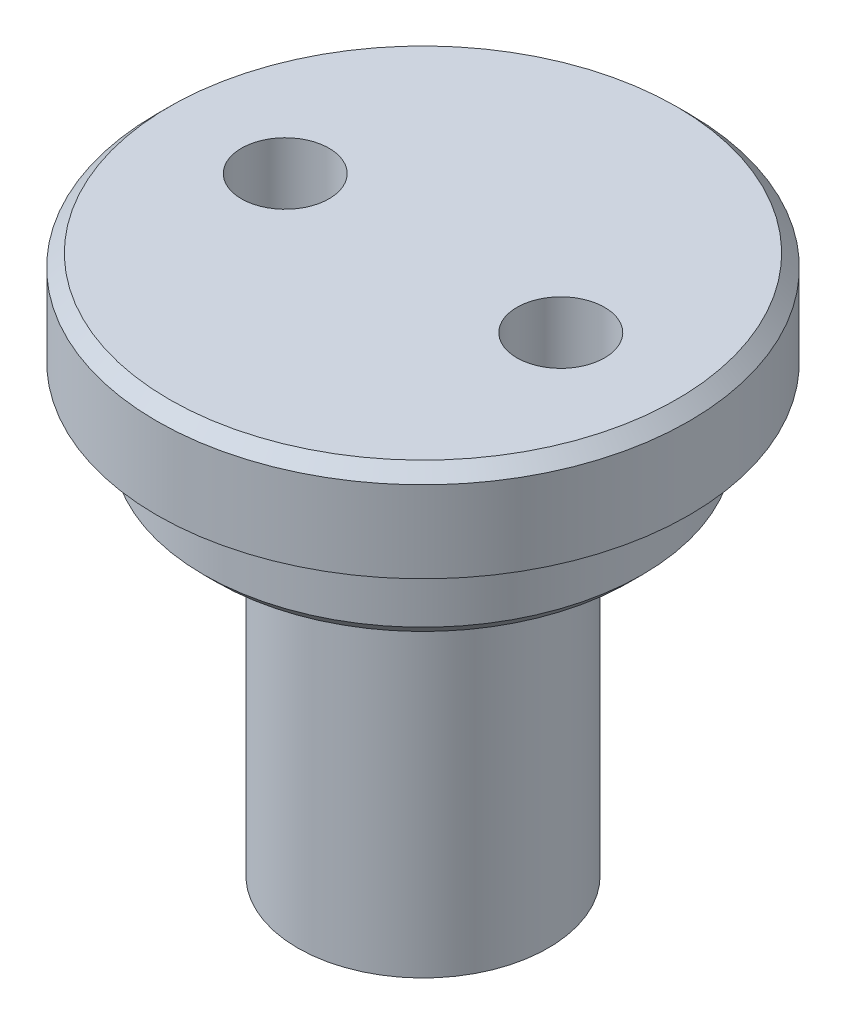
ISO-10303-21;
HEADER;
FILE_DESCRIPTION(('STEP AP214'),'2;1');
FILE_NAME('part.step','',(''),(''),'','','');
FILE_SCHEMA(('AUTOMOTIVE_DESIGN { 1 0 10303 214 1 1 1 1 }'));
ENDSEC;
DATA;
#1=APPLICATION_CONTEXT('core data for automotive mechanical design processes');
#2=APPLICATION_PROTOCOL_DEFINITION('international standard','automotive_design',2000,#1);
#3=PRODUCT_CONTEXT('',#1,'mechanical');
#4=PRODUCT('Part','Part','',(#3));
#5=PRODUCT_RELATED_PRODUCT_CATEGORY('part','',(#4));
#6=PRODUCT_DEFINITION_FORMATION('','',#4);
#7=PRODUCT_DEFINITION_CONTEXT('part definition',#1,'design');
#8=PRODUCT_DEFINITION('design','',#6,#7);
#9=PRODUCT_DEFINITION_SHAPE('','',#8);
#10=(LENGTH_UNIT() NAMED_UNIT(*) SI_UNIT(.MILLI.,.METRE.));
#11=(NAMED_UNIT(*) PLANE_ANGLE_UNIT() SI_UNIT($,.RADIAN.));
#12=(NAMED_UNIT(*) SI_UNIT($,.STERADIAN.) SOLID_ANGLE_UNIT());
#13=UNCERTAINTY_MEASURE_WITH_UNIT(LENGTH_MEASURE(1.E-05),#10,'distance_accuracy_value','');
#14=(GEOMETRIC_REPRESENTATION_CONTEXT(3) GLOBAL_UNCERTAINTY_ASSIGNED_CONTEXT((#13)) GLOBAL_UNIT_ASSIGNED_CONTEXT((#10,
#11,#12)) REPRESENTATION_CONTEXT('',''));
#15=CARTESIAN_POINT('',(0.,0.,0.));
#16=DIRECTION('',(0.,0.,1.));
#17=DIRECTION('',(1.,0.,0.));
#18=AXIS2_PLACEMENT_3D('',#15,#16,#17);
#19=CARTESIAN_POINT('',(0.,-8.9,0.));
#20=DIRECTION('',(0.,-1.,0.));
#21=DIRECTION('',(0.,0.,-1.));
#22=AXIS2_PLACEMENT_3D('',#19,#20,#21);
#23=PLANE('',#22);
#24=CARTESIAN_POINT('',(0.,-8.89999999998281,0.));
#25=DIRECTION('',(0.,1.,0.));
#26=DIRECTION('',(0.,0.,1.));
#27=AXIS2_PLACEMENT_3D('',#24,#25,#26);
#28=CIRCLE('',#27,1.50000000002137);
#29=CARTESIAN_POINT('',(0.,-8.89999999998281,1.50000000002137));
#30=VERTEX_POINT('',#29);
#31=EDGE_CURVE('P0_E17',#30,#30,#28,.T.);
#32=ORIENTED_EDGE('',*,*,#31,.F.);
#33=EDGE_LOOP('',(#32));
#34=FACE_BOUND('',#33,.T.);
#35=ADVANCED_FACE('P0_F14',(#34),#23,.T.);
#36=CARTESIAN_POINT('',(0.,-8.61132486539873,0.));
#37=DIRECTION('',(0.,1.,0.));
#38=DIRECTION('',(0.,0.,1.));
#39=AXIS2_PLACEMENT_3D('',#36,#37,#38);
#40=CONICAL_SURFACE('',#39,2.00000000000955,1.04719755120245);
#41=ORIENTED_EDGE('',*,*,#31,.T.);
#42=EDGE_LOOP('',(#41));
#43=FACE_BOUND('',#42,.T.);
#44=CARTESIAN_POINT('',(0.,-8.611324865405,0.));
#45=DIRECTION('',(0.,-1.,0.));
#46=DIRECTION('',(0.,0.,-1.));
#47=AXIS2_PLACEMENT_3D('',#44,#45,#46);
#48=CIRCLE('',#47,2.);
#49=CARTESIAN_POINT('',(0.,-8.611324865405,-2.));
#50=VERTEX_POINT('',#49);
#51=EDGE_CURVE('P0_E29',#50,#50,#48,.F.);
#52=ORIENTED_EDGE('',*,*,#51,.F.);
#53=EDGE_LOOP('',(#52));
#54=FACE_BOUND('',#53,.T.);
#55=ADVANCED_FACE('P0_F60',(#43,#54),#40,.T.);
#56=CARTESIAN_POINT('',(0.,0.445,0.));
#57=DIRECTION('',(0.,-1.,0.));
#58=DIRECTION('',(0.,0.,-1.));
#59=AXIS2_PLACEMENT_3D('',#56,#57,#58);
#60=CYLINDRICAL_SURFACE('',#59,2.);
#61=CARTESIAN_POINT('',(0.,-2.9,0.));
#62=DIRECTION('',(0.,-1.,0.));
#63=DIRECTION('',(0.,0.,-1.));
#64=AXIS2_PLACEMENT_3D('',#61,#62,#63);
#65=CIRCLE('',#64,2.);
#66=CARTESIAN_POINT('',(0.,-2.9,-2.));
#67=VERTEX_POINT('',#66);
#68=EDGE_CURVE('P0_E50',#67,#67,#65,.F.);
#69=ORIENTED_EDGE('',*,*,#68,.F.);
#70=EDGE_LOOP('',(#69));
#71=FACE_BOUND('',#70,.T.);
#72=ORIENTED_EDGE('',*,*,#51,.T.);
#73=EDGE_LOOP('',(#72));
#74=FACE_BOUND('',#73,.T.);
#75=ADVANCED_FACE('P0_F68',(#71,#74),#60,.T.);
#76=CARTESIAN_POINT('',(0.,-2.9,0.));
#77=DIRECTION('',(0.,-1.,0.));
#78=DIRECTION('',(0.,0.,-1.));
#79=AXIS2_PLACEMENT_3D('',#76,#77,#78);
#80=PLANE('',#79);
#81=ORIENTED_EDGE('',*,*,#68,.T.);
#82=EDGE_LOOP('',(#81));
#83=FACE_BOUND('',#82,.T.);
#84=CARTESIAN_POINT('',(0.,-2.900000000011,0.));
#85=DIRECTION('',(0.,1.,0.));
#86=DIRECTION('',(0.,0.,1.));
#87=AXIS2_PLACEMENT_3D('',#84,#85,#86);
#88=CIRCLE('',#87,3.29999999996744);
#89=CARTESIAN_POINT('',(0.,-2.900000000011,3.29999999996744));
#90=VERTEX_POINT('',#89);
#91=EDGE_CURVE('P0_E48',#90,#90,#88,.T.);
#92=ORIENTED_EDGE('',*,*,#91,.F.);
#93=EDGE_LOOP('',(#92));
#94=FACE_BOUND('',#93,.T.);
#95=ADVANCED_FACE('P0_F112',(#83,#94),#80,.T.);
#96=CARTESIAN_POINT('',(0.,-2.70000000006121,0.));
#97=DIRECTION('',(0.,1.,0.));
#98=DIRECTION('',(0.,0.,1.));
#99=AXIS2_PLACEMENT_3D('',#96,#97,#98);
#100=CONICAL_SURFACE('',#99,3.49999999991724,0.785398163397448);
#101=ORIENTED_EDGE('',*,*,#91,.T.);
#102=EDGE_LOOP('',(#101));
#103=FACE_BOUND('',#102,.T.);
#104=CARTESIAN_POINT('',(0.,-2.7,0.));
#105=DIRECTION('',(0.,-1.,0.));
#106=DIRECTION('',(0.,0.,-1.));
#107=AXIS2_PLACEMENT_3D('',#104,#105,#106);
#108=CIRCLE('',#107,3.5);
#109=CARTESIAN_POINT('',(0.,-2.7,-3.5));
#110=VERTEX_POINT('',#109);
#111=EDGE_CURVE('P0_E47',#110,#110,#108,.F.);
#112=ORIENTED_EDGE('',*,*,#111,.F.);
#113=EDGE_LOOP('',(#112));
#114=FACE_BOUND('',#113,.T.);
#115=ADVANCED_FACE('P0_F108',(#103,#114),#100,.T.);
#116=CARTESIAN_POINT('',(0.,0.445,0.));
#117=DIRECTION('',(0.,-1.,0.));
#118=DIRECTION('',(0.,0.,-1.));
#119=AXIS2_PLACEMENT_3D('',#116,#117,#118);
#120=CYLINDRICAL_SURFACE('',#119,3.5);
#121=CARTESIAN_POINT('',(0.,-1.5,0.));
#122=DIRECTION('',(0.,-1.,0.));
#123=DIRECTION('',(0.,0.,-1.));
#124=AXIS2_PLACEMENT_3D('',#121,#122,#123);
#125=CIRCLE('',#124,3.5);
#126=CARTESIAN_POINT('',(0.,-1.5,-3.5));
#127=VERTEX_POINT('',#126);
#128=EDGE_CURVE('P0_E44',#127,#127,#125,.F.);
#129=ORIENTED_EDGE('',*,*,#128,.F.);
#130=EDGE_LOOP('',(#129));
#131=FACE_BOUND('',#130,.T.);
#132=ORIENTED_EDGE('',*,*,#111,.T.);
#133=EDGE_LOOP('',(#132));
#134=FACE_BOUND('',#133,.T.);
#135=ADVANCED_FACE('P0_F104',(#131,#134),#120,.T.);
#136=CARTESIAN_POINT('',(0.,-1.5,0.));
#137=DIRECTION('',(0.,-1.,0.));
#138=DIRECTION('',(0.,0.,-1.));
#139=AXIS2_PLACEMENT_3D('',#136,#137,#138);
#140=PLANE('',#139);
#141=ORIENTED_EDGE('',*,*,#128,.T.);
#142=EDGE_LOOP('',(#141));
#143=FACE_BOUND('',#142,.T.);
#144=CARTESIAN_POINT('',(0.,-1.5,0.));
#145=DIRECTION('',(0.,-1.,0.));
#146=DIRECTION('',(0.,0.,-1.));
#147=AXIS2_PLACEMENT_3D('',#144,#145,#146);
#148=CIRCLE('',#147,4.25);
#149=CARTESIAN_POINT('',(0.,-1.5,-4.25));
#150=VERTEX_POINT('',#149);
#151=EDGE_CURVE('P0_E41',#150,#150,#148,.F.);
#152=ORIENTED_EDGE('',*,*,#151,.F.);
#153=EDGE_LOOP('',(#152));
#154=FACE_BOUND('',#153,.T.);
#155=ADVANCED_FACE('P0_F100',(#143,#154),#140,.T.);
#156=CARTESIAN_POINT('',(0.,0.445,0.));
#157=DIRECTION('',(0.,-1.,0.));
#158=DIRECTION('',(0.,0.,-1.));
#159=AXIS2_PLACEMENT_3D('',#156,#157,#158);
#160=CYLINDRICAL_SURFACE('',#159,4.25);
#161=ORIENTED_EDGE('',*,*,#151,.T.);
#162=EDGE_LOOP('',(#161));
#163=FACE_BOUND('',#162,.T.);
#164=CARTESIAN_POINT('',(0.,-0.200000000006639,0.));
#165=DIRECTION('',(0.,-1.,0.));
#166=DIRECTION('',(-1.,0.,0.));
#167=AXIS2_PLACEMENT_3D('',#164,#165,#166);
#168=CIRCLE('',#167,4.25000000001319);
#169=CARTESIAN_POINT('',(-4.25000000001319,-0.200000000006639,0.));
#170=VERTEX_POINT('',#169);
#171=EDGE_CURVE('P0_E40',#170,#170,#168,.F.);
#172=ORIENTED_EDGE('',*,*,#171,.F.);
#173=EDGE_LOOP('',(#172));
#174=FACE_BOUND('',#173,.T.);
#175=ADVANCED_FACE('P0_F96',(#163,#174),#160,.T.);
#176=CARTESIAN_POINT('',(0.,-2.2,0.));
#177=DIRECTION('',(0.,1.,0.));
#178=DIRECTION('',(0.,0.,1.));
#179=AXIS2_PLACEMENT_3D('',#176,#177,#178);
#180=PLANE('',#179);
#181=CARTESIAN_POINT('',(2.2,-2.2,0.));
#182=DIRECTION('',(0.,1.,0.));
#183=DIRECTION('',(0.,0.,1.));
#184=AXIS2_PLACEMENT_3D('',#181,#182,#183);
#185=CIRCLE('',#184,0.7);
#186=CARTESIAN_POINT('',(2.2,-2.2,0.7));
#187=VERTEX_POINT('',#186);
#188=EDGE_CURVE('P0_E37',#187,#187,#185,.T.);
#189=ORIENTED_EDGE('',*,*,#188,.T.);
#190=EDGE_LOOP('',(#189));
#191=FACE_BOUND('',#190,.T.);
#192=ADVANCED_FACE('P0_F92',(#191),#180,.T.);
#193=CARTESIAN_POINT('',(0.,-2.2,0.));
#194=DIRECTION('',(0.,1.,0.));
#195=DIRECTION('',(0.,0.,1.));
#196=AXIS2_PLACEMENT_3D('',#193,#194,#195);
#197=PLANE('',#196);
#198=CARTESIAN_POINT('',(-2.2,-2.2,0.));
#199=DIRECTION('',(0.,1.,0.));
#200=DIRECTION('',(0.,0.,1.));
#201=AXIS2_PLACEMENT_3D('',#198,#199,#200);
#202=CIRCLE('',#201,0.7);
#203=CARTESIAN_POINT('',(-2.2,-2.2,0.7));
#204=VERTEX_POINT('',#203);
#205=EDGE_CURVE('P0_E34',#204,#204,#202,.T.);
#206=ORIENTED_EDGE('',*,*,#205,.T.);
#207=EDGE_LOOP('',(#206));
#208=FACE_BOUND('',#207,.T.);
#209=ADVANCED_FACE('P0_F88',(#208),#197,.T.);
#210=CARTESIAN_POINT('',(0.,-0.200000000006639,0.));
#211=DIRECTION('',(0.,-1.,0.));
#212=DIRECTION('',(0.,0.,-1.));
#213=AXIS2_PLACEMENT_3D('',#210,#211,#212);
#214=CONICAL_SURFACE('',#213,4.25000000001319,0.785398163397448);
#215=ORIENTED_EDGE('',*,*,#171,.T.);
#216=EDGE_LOOP('',(#215));
#217=FACE_BOUND('',#216,.T.);
#218=CARTESIAN_POINT('',(0.,5.6843418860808E-11,0.));
#219=DIRECTION('',(0.,-1.,0.));
#220=DIRECTION('',(0.,0.,-1.));
#221=AXIS2_PLACEMENT_3D('',#218,#219,#220);
#222=CIRCLE('',#221,4.0499999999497);
#223=CARTESIAN_POINT('',(0.,5.6843418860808E-11,-4.0499999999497));
#224=VERTEX_POINT('',#223);
#225=EDGE_CURVE('P0_E26',#224,#224,#222,.T.);
#226=ORIENTED_EDGE('',*,*,#225,.T.);
#227=EDGE_LOOP('',(#226));
#228=FACE_BOUND('',#227,.T.);
#229=ADVANCED_FACE('P0_F84',(#217,#228),#214,.T.);
#230=CARTESIAN_POINT('',(2.2,0.,0.));
#231=DIRECTION('',(0.,1.,0.));
#232=DIRECTION('',(0.,0.,1.));
#233=AXIS2_PLACEMENT_3D('',#230,#231,#232);
#234=CYLINDRICAL_SURFACE('',#233,0.7);
#235=ORIENTED_EDGE('',*,*,#188,.F.);
#236=EDGE_LOOP('',(#235));
#237=FACE_BOUND('',#236,.T.);
#238=CARTESIAN_POINT('',(2.2,0.,0.));
#239=DIRECTION('',(0.,1.,0.));
#240=DIRECTION('',(0.,0.,1.));
#241=AXIS2_PLACEMENT_3D('',#238,#239,#240);
#242=CIRCLE('',#241,0.7);
#243=CARTESIAN_POINT('',(2.2,0.,0.7));
#244=VERTEX_POINT('',#243);
#245=EDGE_CURVE('P0_E21',#244,#244,#242,.T.);
#246=ORIENTED_EDGE('',*,*,#245,.T.);
#247=EDGE_LOOP('',(#246));
#248=FACE_BOUND('',#247,.T.);
#249=ADVANCED_FACE('P0_F77',(#237,#248),#234,.F.);
#250=CARTESIAN_POINT('',(-2.2,0.,0.));
#251=DIRECTION('',(0.,1.,0.));
#252=DIRECTION('',(0.,0.,1.));
#253=AXIS2_PLACEMENT_3D('',#250,#251,#252);
#254=CYLINDRICAL_SURFACE('',#253,0.7);
#255=ORIENTED_EDGE('',*,*,#205,.F.);
#256=EDGE_LOOP('',(#255));
#257=FACE_BOUND('',#256,.T.);
#258=CARTESIAN_POINT('',(-2.2,0.,0.));
#259=DIRECTION('',(0.,1.,0.));
#260=DIRECTION('',(0.,0.,1.));
#261=AXIS2_PLACEMENT_3D('',#258,#259,#260);
#262=CIRCLE('',#261,0.7);
#263=CARTESIAN_POINT('',(-2.2,0.,0.7));
#264=VERTEX_POINT('',#263);
#265=EDGE_CURVE('P0_E10',#264,#264,#262,.T.);
#266=ORIENTED_EDGE('',*,*,#265,.T.);
#267=EDGE_LOOP('',(#266));
#268=FACE_BOUND('',#267,.T.);
#269=ADVANCED_FACE('P0_F71',(#257,#268),#254,.F.);
#270=CARTESIAN_POINT('',(0.,0.,0.));
#271=DIRECTION('',(0.,-1.,0.));
#272=DIRECTION('',(0.,0.,-1.));
#273=AXIS2_PLACEMENT_3D('',#270,#271,#272);
#274=PLANE('',#273);
#275=ORIENTED_EDGE('',*,*,#265,.F.);
#276=EDGE_LOOP('',(#275));
#277=FACE_BOUND('',#276,.T.);
#278=ORIENTED_EDGE('',*,*,#245,.F.);
#279=EDGE_LOOP('',(#278));
#280=FACE_BOUND('',#279,.T.);
#281=ORIENTED_EDGE('',*,*,#225,.F.);
#282=EDGE_LOOP('',(#281));
#283=FACE_BOUND('',#282,.T.);
#284=ADVANCED_FACE('P0_F69',(#277,#280,#283),#274,.F.);
#285=CLOSED_SHELL('',(#35,#55,#75,#95,#115,#135,#155,#175,#192,#209,#229,#249,#269,#284));
#286=MANIFOLD_SOLID_BREP('P0_B1',#285);
#287=CARTESIAN_POINT('',(0.,-2.9,0.));
#288=DIRECTION('',(0.,1.,0.));
#289=DIRECTION('',(0.,0.,1.));
#290=AXIS2_PLACEMENT_3D('',#287,#288,#289);
#291=CYLINDRICAL_SURFACE('',#290,1.7);
#292=CARTESIAN_POINT('',(0.,-2.9,0.));
#293=DIRECTION('',(0.,1.,0.));
#294=DIRECTION('',(0.,0.,1.));
#295=AXIS2_PLACEMENT_3D('',#292,#293,#294);
#296=CIRCLE('',#295,1.7);
#297=CARTESIAN_POINT('',(0.,-2.9,1.7));
#298=VERTEX_POINT('',#297);
#299=EDGE_CURVE('P1_E15',#298,#298,#296,.F.);
#300=ORIENTED_EDGE('',*,*,#299,.T.);
#301=EDGE_LOOP('',(#300));
#302=FACE_BOUND('',#301,.T.);
#303=CARTESIAN_POINT('',(0.,-8.784529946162,0.));
#304=DIRECTION('',(0.,1.,0.));
#305=DIRECTION('',(0.,0.,1.));
#306=AXIS2_PLACEMENT_3D('',#303,#304,#305);
#307=CIRCLE('',#306,1.7);
#308=CARTESIAN_POINT('',(0.,-8.784529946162,1.7));
#309=VERTEX_POINT('',#308);
#310=EDGE_CURVE('P1_E10',#309,#309,#307,.T.);
#311=ORIENTED_EDGE('',*,*,#310,.T.);
#312=EDGE_LOOP('',(#311));
#313=FACE_BOUND('',#312,.T.);
#314=ADVANCED_FACE('P1_F14',(#302,#313),#291,.T.);
#315=OPEN_SHELL('',(#314));
#316=SHELL_BASED_SURFACE_MODEL('P1_B1',(#315));
#317=ADVANCED_BREP_SHAPE_REPRESENTATION('',(#18,#286),#14);
#318=MANIFOLD_SURFACE_SHAPE_REPRESENTATION('',(#18,#316),#14);
#319=SHAPE_REPRESENTATION('',(#18),#14);
#320=SHAPE_DEFINITION_REPRESENTATION(#9,#319);
#321=SHAPE_REPRESENTATION_RELATIONSHIP('','',#319,#317);
#322=SHAPE_REPRESENTATION_RELATIONSHIP('','',#319,#318);
ENDSEC;
END-ISO-10303-21;
